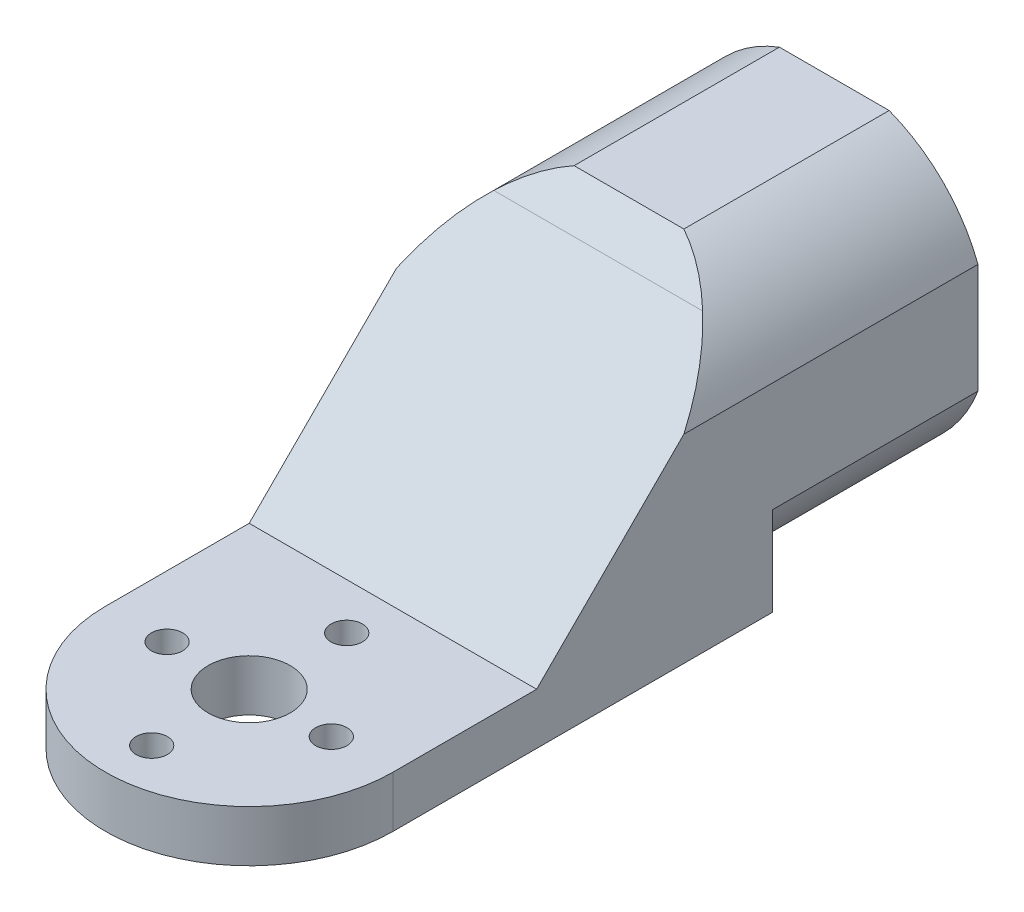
ISO-10303-21;
HEADER;
FILE_DESCRIPTION(('STEP AP214'),'2;1');
FILE_NAME('part.step','',(''),(''),'','','');
FILE_SCHEMA(('AUTOMOTIVE_DESIGN { 1 0 10303 214 1 1 1 1 }'));
ENDSEC;
DATA;
#1=APPLICATION_CONTEXT('core data for automotive mechanical design processes');
#2=APPLICATION_PROTOCOL_DEFINITION('international standard','automotive_design',2000,#1);
#3=PRODUCT_CONTEXT('',#1,'mechanical');
#4=PRODUCT('Part','Part','',(#3));
#5=PRODUCT_RELATED_PRODUCT_CATEGORY('part','',(#4));
#6=PRODUCT_DEFINITION_FORMATION('','',#4);
#7=PRODUCT_DEFINITION_CONTEXT('part definition',#1,'design');
#8=PRODUCT_DEFINITION('design','',#6,#7);
#9=PRODUCT_DEFINITION_SHAPE('','',#8);
#10=(LENGTH_UNIT() NAMED_UNIT(*) SI_UNIT(.MILLI.,.METRE.));
#11=(NAMED_UNIT(*) PLANE_ANGLE_UNIT() SI_UNIT($,.RADIAN.));
#12=(NAMED_UNIT(*) SI_UNIT($,.STERADIAN.) SOLID_ANGLE_UNIT());
#13=UNCERTAINTY_MEASURE_WITH_UNIT(LENGTH_MEASURE(1.E-05),#10,'distance_accuracy_value','');
#14=(GEOMETRIC_REPRESENTATION_CONTEXT(3) GLOBAL_UNCERTAINTY_ASSIGNED_CONTEXT((#13)) GLOBAL_UNIT_ASSIGNED_CONTEXT((#10,
#11,#12)) REPRESENTATION_CONTEXT('',''));
#15=CARTESIAN_POINT('',(0.,0.,0.));
#16=DIRECTION('',(0.,0.,1.));
#17=DIRECTION('',(1.,0.,0.));
#18=AXIS2_PLACEMENT_3D('',#15,#16,#17);
#19=CARTESIAN_POINT('',(0.,0.,-37.));
#20=DIRECTION('',(0.,0.,1.));
#21=DIRECTION('',(1.,0.,0.));
#22=AXIS2_PLACEMENT_3D('',#19,#20,#21);
#23=PLANE('',#22);
#24=CARTESIAN_POINT('',(0.,14.,-37.));
#25=DIRECTION('',(0.,0.,-1.));
#26=DIRECTION('',(-1.,0.,0.));
#27=AXIS2_PLACEMENT_3D('',#24,#25,#26);
#28=CIRCLE('',#27,14.986);
#29=CARTESIAN_POINT('',(-5.34604489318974,0.,-37.));
#30=VERTEX_POINT('',#29);
#31=CARTESIAN_POINT('',(-14.,8.65395510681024,-37.));
#32=VERTEX_POINT('',#31);
#33=EDGE_CURVE('E56',#30,#32,#28,.T.);
#34=ORIENTED_EDGE('',*,*,#33,.F.);
#35=DIRECTION('',(-1.,0.,0.));
#36=VECTOR('',#35,1.);
#37=CARTESIAN_POINT('',(14.,0.,-37.));
#38=LINE('',#37,#36);
#39=CARTESIAN_POINT('',(-14.,0.,-37.));
#40=VERTEX_POINT('',#39);
#41=EDGE_CURVE('E222',#30,#40,#38,.T.);
#42=ORIENTED_EDGE('',*,*,#41,.T.);
#43=DIRECTION('',(0.,1.,0.));
#44=VECTOR('',#43,1.);
#45=CARTESIAN_POINT('',(-14.,0.,-37.));
#46=LINE('',#45,#44);
#47=EDGE_CURVE('E53',#40,#32,#46,.T.);
#48=ORIENTED_EDGE('',*,*,#47,.T.);
#49=EDGE_LOOP('',(#34,#42,#48));
#50=FACE_BOUND('',#49,.T.);
#51=ADVANCED_FACE('F35',(#50),#23,.F.);
#52=CARTESIAN_POINT('',(14.,8.65395510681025,-37.));
#53=VERTEX_POINT('',#52);
#54=CARTESIAN_POINT('',(5.34604489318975,0.,-37.));
#55=VERTEX_POINT('',#54);
#56=EDGE_CURVE('E232',#53,#55,#28,.T.);
#57=ORIENTED_EDGE('',*,*,#56,.F.);
#58=DIRECTION('',(0.,-1.,0.));
#59=VECTOR('',#58,1.);
#60=CARTESIAN_POINT('',(14.,0.,-37.));
#61=LINE('',#60,#59);
#62=CARTESIAN_POINT('',(14.,0.,-37.));
#63=VERTEX_POINT('',#62);
#64=EDGE_CURVE('E140',#53,#63,#61,.T.);
#65=ORIENTED_EDGE('',*,*,#64,.T.);
#66=EDGE_CURVE('E221',#63,#55,#38,.T.);
#67=ORIENTED_EDGE('',*,*,#66,.T.);
#68=EDGE_LOOP('',(#57,#65,#67));
#69=FACE_BOUND('',#68,.T.);
#70=ADVANCED_FACE('F357',(#69),#23,.F.);
#71=CARTESIAN_POINT('',(-14.,5.,0.));
#72=DIRECTION('',(1.,0.,0.));
#73=DIRECTION('',(0.,0.,-1.));
#74=AXIS2_PLACEMENT_3D('',#71,#72,#73);
#75=PLANE('',#74);
#76=DIRECTION('',(0.,-0.707106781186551,0.707106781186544));
#77=VECTOR('',#76,1.);
#78=CARTESIAN_POINT('',(-14.,-2.00000000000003,-7.00000000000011));
#79=LINE('',#78,#77);
#80=CARTESIAN_POINT('',(-14.,5.,-14.0000000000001));
#81=VERTEX_POINT('',#80);
#82=CARTESIAN_POINT('',(-14.,19.3460448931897,-28.3460448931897));
#83=VERTEX_POINT('',#82);
#84=EDGE_CURVE('E11',#81,#83,#79,.F.);
#85=ORIENTED_EDGE('',*,*,#84,.T.);
#86=DIRECTION('',(0.,0.,1.));
#87=VECTOR('',#86,1.);
#88=CARTESIAN_POINT('',(-14.,19.3460448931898,-57.));
#89=LINE('',#88,#87);
#90=CARTESIAN_POINT('',(-14.,19.3460448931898,-57.));
#91=VERTEX_POINT('',#90);
#92=EDGE_CURVE('E130',#91,#83,#89,.T.);
#93=ORIENTED_EDGE('',*,*,#92,.F.);
#94=DIRECTION('',(0.,1.,0.));
#95=VECTOR('',#94,1.);
#96=CARTESIAN_POINT('',(-14.,0.,-57.));
#97=LINE('',#96,#95);
#98=CARTESIAN_POINT('',(-14.,8.65395510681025,-57.));
#99=VERTEX_POINT('',#98);
#100=EDGE_CURVE('E240',#99,#91,#97,.T.);
#101=ORIENTED_EDGE('',*,*,#100,.F.);
#102=DIRECTION('',(0.,0.,1.));
#103=VECTOR('',#102,1.);
#104=CARTESIAN_POINT('',(-14.,8.65395510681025,-57.));
#105=LINE('',#104,#103);
#106=EDGE_CURVE('E241',#99,#32,#105,.T.);
#107=ORIENTED_EDGE('',*,*,#106,.T.);
#108=ORIENTED_EDGE('',*,*,#47,.F.);
#109=DIRECTION('',(0.,0.,1.));
#110=VECTOR('',#109,1.);
#111=CARTESIAN_POINT('',(-14.,0.,0.));
#112=LINE('',#111,#110);
#113=CARTESIAN_POINT('',(-14.,0.,0.));
#114=VERTEX_POINT('',#113);
#115=EDGE_CURVE('E198',#40,#114,#112,.T.);
#116=ORIENTED_EDGE('',*,*,#115,.T.);
#117=DIRECTION('',(0.,-1.,0.));
#118=VECTOR('',#117,1.);
#119=CARTESIAN_POINT('',(-14.,5.,0.));
#120=LINE('',#119,#118);
#121=CARTESIAN_POINT('',(-14.,5.,0.));
#122=VERTEX_POINT('',#121);
#123=EDGE_CURVE('E157',#122,#114,#120,.T.);
#124=ORIENTED_EDGE('',*,*,#123,.F.);
#125=DIRECTION('',(0.,0.,1.));
#126=VECTOR('',#125,1.);
#127=CARTESIAN_POINT('',(-14.,5.,0.));
#128=LINE('',#127,#126);
#129=EDGE_CURVE('E155',#81,#122,#128,.T.);
#130=ORIENTED_EDGE('',*,*,#129,.F.);
#131=EDGE_LOOP('',(#85,#93,#101,#107,#108,#116,#124,#130));
#132=FACE_BOUND('',#131,.T.);
#133=ADVANCED_FACE('F153',(#132),#75,.F.);
#134=CARTESIAN_POINT('',(0.,5.,0.));
#135=DIRECTION('',(0.,-1.,0.));
#136=DIRECTION('',(0.,0.,-1.));
#137=AXIS2_PLACEMENT_3D('',#134,#135,#136);
#138=CYLINDRICAL_SURFACE('',#137,14.);
#139=CARTESIAN_POINT('',(0.,0.,0.));
#140=DIRECTION('',(0.,1.,0.));
#141=DIRECTION('',(0.,0.,1.));
#142=AXIS2_PLACEMENT_3D('',#139,#140,#141);
#143=CIRCLE('',#142,14.);
#144=CARTESIAN_POINT('',(14.,0.,0.));
#145=VERTEX_POINT('',#144);
#146=EDGE_CURVE('E195',#114,#145,#143,.T.);
#147=ORIENTED_EDGE('',*,*,#146,.T.);
#148=DIRECTION('',(0.,-1.,0.));
#149=VECTOR('',#148,1.);
#150=CARTESIAN_POINT('',(14.,5.,0.));
#151=LINE('',#150,#149);
#152=CARTESIAN_POINT('',(14.,5.,0.));
#153=VERTEX_POINT('',#152);
#154=EDGE_CURVE('E178',#153,#145,#151,.T.);
#155=ORIENTED_EDGE('',*,*,#154,.F.);
#156=CARTESIAN_POINT('',(0.,5.,0.));
#157=DIRECTION('',(0.,1.,0.));
#158=DIRECTION('',(0.,0.,1.));
#159=AXIS2_PLACEMENT_3D('',#156,#157,#158);
#160=CIRCLE('',#159,14.);
#161=EDGE_CURVE('E161',#122,#153,#160,.T.);
#162=ORIENTED_EDGE('',*,*,#161,.F.);
#163=ORIENTED_EDGE('',*,*,#123,.T.);
#164=EDGE_LOOP('',(#147,#155,#162,#163));
#165=FACE_BOUND('',#164,.T.);
#166=ADVANCED_FACE('F329',(#165),#138,.T.);
#167=CARTESIAN_POINT('',(8.,5.,0.));
#168=DIRECTION('',(0.,-1.,0.));
#169=DIRECTION('',(0.,0.,-1.));
#170=AXIS2_PLACEMENT_3D('',#167,#168,#169);
#171=CYLINDRICAL_SURFACE('',#170,1.525);
#172=CARTESIAN_POINT('',(8.,5.,0.));
#173=DIRECTION('',(0.,1.,0.));
#174=DIRECTION('',(0.,0.,1.));
#175=AXIS2_PLACEMENT_3D('',#172,#173,#174);
#176=CIRCLE('',#175,1.525);
#177=CARTESIAN_POINT('',(8.,5.,1.525));
#178=VERTEX_POINT('',#177);
#179=EDGE_CURVE('E202',#178,#178,#176,.T.);
#180=ORIENTED_EDGE('',*,*,#179,.T.);
#181=EDGE_LOOP('',(#180));
#182=FACE_BOUND('',#181,.T.);
#183=CARTESIAN_POINT('',(8.,0.,0.));
#184=DIRECTION('',(0.,1.,0.));
#185=DIRECTION('',(0.,0.,1.));
#186=AXIS2_PLACEMENT_3D('',#183,#184,#185);
#187=CIRCLE('',#186,1.525);
#188=CARTESIAN_POINT('',(8.,0.,1.525));
#189=VERTEX_POINT('',#188);
#190=EDGE_CURVE('E167',#189,#189,#187,.T.);
#191=ORIENTED_EDGE('',*,*,#190,.F.);
#192=EDGE_LOOP('',(#191));
#193=FACE_BOUND('',#192,.T.);
#194=ADVANCED_FACE('F434',(#182,#193),#171,.F.);
#195=CARTESIAN_POINT('',(-8.,5.,0.));
#196=DIRECTION('',(0.,-1.,0.));
#197=DIRECTION('',(0.,0.,-1.));
#198=AXIS2_PLACEMENT_3D('',#195,#196,#197);
#199=CYLINDRICAL_SURFACE('',#198,1.525);
#200=CARTESIAN_POINT('',(-8.,5.,0.));
#201=DIRECTION('',(0.,1.,0.));
#202=DIRECTION('',(0.,0.,1.));
#203=AXIS2_PLACEMENT_3D('',#200,#201,#202);
#204=CIRCLE('',#203,1.525);
#205=CARTESIAN_POINT('',(-8.,5.,1.525));
#206=VERTEX_POINT('',#205);
#207=EDGE_CURVE('E205',#206,#206,#204,.T.);
#208=ORIENTED_EDGE('',*,*,#207,.T.);
#209=EDGE_LOOP('',(#208));
#210=FACE_BOUND('',#209,.T.);
#211=CARTESIAN_POINT('',(-8.,0.,0.));
#212=DIRECTION('',(0.,1.,0.));
#213=DIRECTION('',(0.,0.,1.));
#214=AXIS2_PLACEMENT_3D('',#211,#212,#213);
#215=CIRCLE('',#214,1.525);
#216=CARTESIAN_POINT('',(-8.,0.,1.525));
#217=VERTEX_POINT('',#216);
#218=EDGE_CURVE('E183',#217,#217,#215,.T.);
#219=ORIENTED_EDGE('',*,*,#218,.F.);
#220=EDGE_LOOP('',(#219));
#221=FACE_BOUND('',#220,.T.);
#222=ADVANCED_FACE('F441',(#210,#221),#199,.F.);
#223=CARTESIAN_POINT('',(0.,5.,0.));
#224=DIRECTION('',(0.,-1.,0.));
#225=DIRECTION('',(0.,0.,-1.));
#226=AXIS2_PLACEMENT_3D('',#223,#224,#225);
#227=CYLINDRICAL_SURFACE('',#226,4.);
#228=CARTESIAN_POINT('',(0.,5.,0.));
#229=DIRECTION('',(0.,1.,0.));
#230=DIRECTION('',(0.,0.,1.));
#231=AXIS2_PLACEMENT_3D('',#228,#229,#230);
#232=CIRCLE('',#231,4.);
#233=CARTESIAN_POINT('',(0.,5.,4.));
#234=VERTEX_POINT('',#233);
#235=EDGE_CURVE('E208',#234,#234,#232,.T.);
#236=ORIENTED_EDGE('',*,*,#235,.T.);
#237=EDGE_LOOP('',(#236));
#238=FACE_BOUND('',#237,.T.);
#239=CARTESIAN_POINT('',(0.,0.,0.));
#240=DIRECTION('',(0.,1.,0.));
#241=DIRECTION('',(0.,0.,1.));
#242=AXIS2_PLACEMENT_3D('',#239,#240,#241);
#243=CIRCLE('',#242,4.);
#244=CARTESIAN_POINT('',(0.,0.,4.));
#245=VERTEX_POINT('',#244);
#246=EDGE_CURVE('E186',#245,#245,#243,.T.);
#247=ORIENTED_EDGE('',*,*,#246,.F.);
#248=EDGE_LOOP('',(#247));
#249=FACE_BOUND('',#248,.T.);
#250=ADVANCED_FACE('F449',(#238,#249),#227,.F.);
#251=CARTESIAN_POINT('',(0.,5.,9.5));
#252=DIRECTION('',(0.,-1.,0.));
#253=DIRECTION('',(0.,0.,-1.));
#254=AXIS2_PLACEMENT_3D('',#251,#252,#253);
#255=CYLINDRICAL_SURFACE('',#254,1.525);
#256=CARTESIAN_POINT('',(0.,5.,9.5));
#257=DIRECTION('',(0.,1.,0.));
#258=DIRECTION('',(0.,0.,1.));
#259=AXIS2_PLACEMENT_3D('',#256,#257,#258);
#260=CIRCLE('',#259,1.525);
#261=CARTESIAN_POINT('',(0.,5.,11.025));
#262=VERTEX_POINT('',#261);
#263=EDGE_CURVE('E211',#262,#262,#260,.T.);
#264=ORIENTED_EDGE('',*,*,#263,.T.);
#265=EDGE_LOOP('',(#264));
#266=FACE_BOUND('',#265,.T.);
#267=CARTESIAN_POINT('',(0.,0.,9.5));
#268=DIRECTION('',(0.,1.,0.));
#269=DIRECTION('',(0.,0.,1.));
#270=AXIS2_PLACEMENT_3D('',#267,#268,#269);
#271=CIRCLE('',#270,1.525);
#272=CARTESIAN_POINT('',(0.,0.,11.025));
#273=VERTEX_POINT('',#272);
#274=EDGE_CURVE('E189',#273,#273,#271,.T.);
#275=ORIENTED_EDGE('',*,*,#274,.F.);
#276=EDGE_LOOP('',(#275));
#277=FACE_BOUND('',#276,.T.);
#278=ADVANCED_FACE('F412',(#266,#277),#255,.F.);
#279=CARTESIAN_POINT('',(14.,5.,0.));
#280=DIRECTION('',(1.,0.,0.));
#281=DIRECTION('',(0.,0.,-1.));
#282=AXIS2_PLACEMENT_3D('',#279,#280,#281);
#283=PLANE('',#282);
#284=DIRECTION('',(0.,0.,1.));
#285=VECTOR('',#284,1.);
#286=CARTESIAN_POINT('',(14.,19.3460448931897,-57.));
#287=LINE('',#286,#285);
#288=CARTESIAN_POINT('',(14.,19.3460448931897,-57.));
#289=VERTEX_POINT('',#288);
#290=CARTESIAN_POINT('',(14.,19.3460448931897,-28.3460448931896));
#291=VERTEX_POINT('',#290);
#292=EDGE_CURVE('E264',#289,#291,#287,.T.);
#293=ORIENTED_EDGE('',*,*,#292,.T.);
#294=DIRECTION('',(0.,0.707106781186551,-0.707106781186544));
#295=VECTOR('',#294,1.);
#296=CARTESIAN_POINT('',(14.,25.0000000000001,-34.));
#297=LINE('',#296,#295);
#298=CARTESIAN_POINT('',(14.,5.,-14.0000000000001));
#299=VERTEX_POINT('',#298);
#300=EDGE_CURVE('E45',#291,#299,#297,.F.);
#301=ORIENTED_EDGE('',*,*,#300,.T.);
#302=DIRECTION('',(0.,0.,1.));
#303=VECTOR('',#302,1.);
#304=CARTESIAN_POINT('',(14.,5.,0.));
#305=LINE('',#304,#303);
#306=EDGE_CURVE('E164',#299,#153,#305,.T.);
#307=ORIENTED_EDGE('',*,*,#306,.T.);
#308=ORIENTED_EDGE('',*,*,#154,.T.);
#309=DIRECTION('',(0.,0.,1.));
#310=VECTOR('',#309,1.);
#311=CARTESIAN_POINT('',(14.,0.,0.));
#312=LINE('',#311,#310);
#313=EDGE_CURVE('E192',#63,#145,#312,.T.);
#314=ORIENTED_EDGE('',*,*,#313,.F.);
#315=ORIENTED_EDGE('',*,*,#64,.F.);
#316=DIRECTION('',(0.,0.,1.));
#317=VECTOR('',#316,1.);
#318=CARTESIAN_POINT('',(14.,8.65395510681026,-57.));
#319=LINE('',#318,#317);
#320=CARTESIAN_POINT('',(14.,8.65395510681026,-57.));
#321=VERTEX_POINT('',#320);
#322=EDGE_CURVE('E258',#321,#53,#319,.T.);
#323=ORIENTED_EDGE('',*,*,#322,.F.);
#324=DIRECTION('',(0.,-1.,0.));
#325=VECTOR('',#324,1.);
#326=CARTESIAN_POINT('',(14.,0.,-57.));
#327=LINE('',#326,#325);
#328=EDGE_CURVE('E283',#289,#321,#327,.T.);
#329=ORIENTED_EDGE('',*,*,#328,.F.);
#330=EDGE_LOOP('',(#293,#301,#307,#308,#314,#315,#323,#329));
#331=FACE_BOUND('',#330,.T.);
#332=ADVANCED_FACE('F298',(#331),#283,.T.);
#333=CARTESIAN_POINT('',(0.,5.,-9.5));
#334=DIRECTION('',(0.,-1.,0.));
#335=DIRECTION('',(0.,0.,-1.));
#336=AXIS2_PLACEMENT_3D('',#333,#334,#335);
#337=CYLINDRICAL_SURFACE('',#336,1.525);
#338=CARTESIAN_POINT('',(0.,5.,-9.5));
#339=DIRECTION('',(0.,1.,0.));
#340=DIRECTION('',(0.,0.,1.));
#341=AXIS2_PLACEMENT_3D('',#338,#339,#340);
#342=CIRCLE('',#341,1.525);
#343=CARTESIAN_POINT('',(0.,5.,-7.975));
#344=VERTEX_POINT('',#343);
#345=EDGE_CURVE('E179',#344,#344,#342,.T.);
#346=ORIENTED_EDGE('',*,*,#345,.T.);
#347=EDGE_LOOP('',(#346));
#348=FACE_BOUND('',#347,.T.);
#349=CARTESIAN_POINT('',(0.,0.,-9.5));
#350=DIRECTION('',(0.,1.,0.));
#351=DIRECTION('',(0.,0.,1.));
#352=AXIS2_PLACEMENT_3D('',#349,#350,#351);
#353=CIRCLE('',#352,1.525);
#354=CARTESIAN_POINT('',(0.,0.,-7.975));
#355=VERTEX_POINT('',#354);
#356=EDGE_CURVE('E162',#355,#355,#353,.T.);
#357=ORIENTED_EDGE('',*,*,#356,.F.);
#358=EDGE_LOOP('',(#357));
#359=FACE_BOUND('',#358,.T.);
#360=ADVANCED_FACE('F334',(#348,#359),#337,.F.);
#361=CARTESIAN_POINT('',(0.,5.,0.));
#362=DIRECTION('',(0.,1.,0.));
#363=DIRECTION('',(0.,0.,1.));
#364=AXIS2_PLACEMENT_3D('',#361,#362,#363);
#365=PLANE('',#364);
#366=ORIENTED_EDGE('',*,*,#306,.F.);
#367=DIRECTION('',(-1.,0.,0.));
#368=VECTOR('',#367,1.);
#369=CARTESIAN_POINT('',(-14.,5.,-14.0000000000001));
#370=LINE('',#369,#368);
#371=EDGE_CURVE('E321',#299,#81,#370,.T.);
#372=ORIENTED_EDGE('',*,*,#371,.T.);
#373=ORIENTED_EDGE('',*,*,#129,.T.);
#374=ORIENTED_EDGE('',*,*,#161,.T.);
#375=EDGE_LOOP('',(#366,#372,#373,#374));
#376=FACE_BOUND('',#375,.T.);
#377=ORIENTED_EDGE('',*,*,#263,.F.);
#378=EDGE_LOOP('',(#377));
#379=FACE_BOUND('',#378,.T.);
#380=ORIENTED_EDGE('',*,*,#235,.F.);
#381=EDGE_LOOP('',(#380));
#382=FACE_BOUND('',#381,.T.);
#383=ORIENTED_EDGE('',*,*,#207,.F.);
#384=EDGE_LOOP('',(#383));
#385=FACE_BOUND('',#384,.T.);
#386=ORIENTED_EDGE('',*,*,#179,.F.);
#387=EDGE_LOOP('',(#386));
#388=FACE_BOUND('',#387,.T.);
#389=ORIENTED_EDGE('',*,*,#345,.F.);
#390=EDGE_LOOP('',(#389));
#391=FACE_BOUND('',#390,.T.);
#392=ADVANCED_FACE('F331',(#376,#379,#382,#385,#388,#391),#365,.T.);
#393=CARTESIAN_POINT('',(0.,0.,0.));
#394=DIRECTION('',(0.,1.,0.));
#395=DIRECTION('',(0.,0.,1.));
#396=AXIS2_PLACEMENT_3D('',#393,#394,#395);
#397=PLANE('',#396);
#398=ORIENTED_EDGE('',*,*,#115,.F.);
#399=ORIENTED_EDGE('',*,*,#41,.F.);
#400=DIRECTION('',(0.,0.,1.));
#401=VECTOR('',#400,1.);
#402=CARTESIAN_POINT('',(-5.34604489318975,0.,-57.));
#403=LINE('',#402,#401);
#404=CARTESIAN_POINT('',(-5.34604489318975,0.,-57.));
#405=VERTEX_POINT('',#404);
#406=EDGE_CURVE('E259',#405,#30,#403,.T.);
#407=ORIENTED_EDGE('',*,*,#406,.F.);
#408=DIRECTION('',(-1.,0.,0.));
#409=VECTOR('',#408,1.);
#410=CARTESIAN_POINT('',(0.,0.,-57.));
#411=LINE('',#410,#409);
#412=CARTESIAN_POINT('',(5.34604489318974,0.,-57.));
#413=VERTEX_POINT('',#412);
#414=EDGE_CURVE('E245',#413,#405,#411,.T.);
#415=ORIENTED_EDGE('',*,*,#414,.F.);
#416=DIRECTION('',(0.,0.,1.));
#417=VECTOR('',#416,1.);
#418=CARTESIAN_POINT('',(5.34604489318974,0.,-57.));
#419=LINE('',#418,#417);
#420=EDGE_CURVE('E255',#413,#55,#419,.T.);
#421=ORIENTED_EDGE('',*,*,#420,.T.);
#422=ORIENTED_EDGE('',*,*,#66,.F.);
#423=ORIENTED_EDGE('',*,*,#313,.T.);
#424=ORIENTED_EDGE('',*,*,#146,.F.);
#425=EDGE_LOOP('',(#398,#399,#407,#415,#421,#422,#423,#424));
#426=FACE_BOUND('',#425,.T.);
#427=ORIENTED_EDGE('',*,*,#274,.T.);
#428=EDGE_LOOP('',(#427));
#429=FACE_BOUND('',#428,.T.);
#430=ORIENTED_EDGE('',*,*,#246,.T.);
#431=EDGE_LOOP('',(#430));
#432=FACE_BOUND('',#431,.T.);
#433=ORIENTED_EDGE('',*,*,#218,.T.);
#434=EDGE_LOOP('',(#433));
#435=FACE_BOUND('',#434,.T.);
#436=ORIENTED_EDGE('',*,*,#190,.T.);
#437=EDGE_LOOP('',(#436));
#438=FACE_BOUND('',#437,.T.);
#439=ORIENTED_EDGE('',*,*,#356,.T.);
#440=EDGE_LOOP('',(#439));
#441=FACE_BOUND('',#440,.T.);
#442=ADVANCED_FACE('F312',(#426,#429,#432,#435,#438,#441),#397,.F.);
#443=CARTESIAN_POINT('',(0.,25.0000000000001,-34.));
#444=DIRECTION('',(0.,0.707106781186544,0.707106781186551));
#445=DIRECTION('',(-1.,0.,0.));
#446=AXIS2_PLACEMENT_3D('',#443,#444,#445);
#447=PLANE('',#446);
#448=DIRECTION('',(1.,0.,0.));
#449=VECTOR('',#448,1.);
#450=CARTESIAN_POINT('',(14.,25.0000000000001,-34.));
#451=LINE('',#450,#449);
#452=CARTESIAN_POINT('',(-10.1774356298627,25.0000000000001,-34.));
#453=VERTEX_POINT('',#452);
#454=CARTESIAN_POINT('',(10.1774356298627,25.0000000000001,-34.));
#455=VERTEX_POINT('',#454);
#456=EDGE_CURVE('E149',#453,#455,#451,.T.);
#457=ORIENTED_EDGE('',*,*,#456,.F.);
#458=CARTESIAN_POINT('',(0.,14.,-23.));
#459=DIRECTION('',(0.,0.707106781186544,0.707106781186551));
#460=DIRECTION('',(0.,0.707106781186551,-0.707106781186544));
#461=AXIS2_PLACEMENT_3D('',#458,#459,#460);
#462=ELLIPSE('',#461,21.1934044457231,14.986);
#463=EDGE_CURVE('E133',#453,#83,#462,.T.);
#464=ORIENTED_EDGE('',*,*,#463,.T.);
#465=ORIENTED_EDGE('',*,*,#84,.F.);
#466=ORIENTED_EDGE('',*,*,#371,.F.);
#467=ORIENTED_EDGE('',*,*,#300,.F.);
#468=CARTESIAN_POINT('',(0.,14.,-23.));
#469=DIRECTION('',(0.,0.707106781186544,0.707106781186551));
#470=DIRECTION('',(0.,0.707106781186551,-0.707106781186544));
#471=AXIS2_PLACEMENT_3D('',#468,#469,#470);
#472=ELLIPSE('',#471,21.1934044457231,14.986);
#473=EDGE_CURVE('E233',#291,#455,#472,.T.);
#474=ORIENTED_EDGE('',*,*,#473,.T.);
#475=EDGE_LOOP('',(#457,#464,#465,#466,#467,#474));
#476=FACE_BOUND('',#475,.T.);
#477=ADVANCED_FACE('F146',(#476),#447,.T.);
#478=CARTESIAN_POINT('',(14.,28.,-37.));
#479=DIRECTION('',(0.,0.707106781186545,0.70710678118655));
#480=DIRECTION('',(-1.,0.,0.));
#481=AXIS2_PLACEMENT_3D('',#478,#479,#480);
#482=PLANE('',#481);
#483=CARTESIAN_POINT('',(0.,14.,-23.0000000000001));
#484=DIRECTION('',(0.,0.707106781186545,0.70710678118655));
#485=DIRECTION('',(0.,0.70710678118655,-0.707106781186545));
#486=AXIS2_PLACEMENT_3D('',#483,#484,#485);
#487=ELLIPSE('',#486,21.1934044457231,14.986);
#488=CARTESIAN_POINT('',(-5.34604489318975,28.,-37.));
#489=VERTEX_POINT('',#488);
#490=EDGE_CURVE('E39',#453,#489,#487,.F.);
#491=ORIENTED_EDGE('',*,*,#490,.F.);
#492=ORIENTED_EDGE('',*,*,#456,.T.);
#493=CARTESIAN_POINT('',(0.,14.,-23.0000000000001));
#494=DIRECTION('',(0.,0.707106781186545,0.70710678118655));
#495=DIRECTION('',(0.,0.70710678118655,-0.707106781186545));
#496=AXIS2_PLACEMENT_3D('',#493,#494,#495);
#497=ELLIPSE('',#496,21.1934044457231,14.986);
#498=CARTESIAN_POINT('',(5.34604489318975,28.,-37.));
#499=VERTEX_POINT('',#498);
#500=EDGE_CURVE('E150',#499,#455,#497,.F.);
#501=ORIENTED_EDGE('',*,*,#500,.F.);
#502=DIRECTION('',(1.,0.,0.));
#503=VECTOR('',#502,1.);
#504=CARTESIAN_POINT('',(0.,28.,-37.));
#505=LINE('',#504,#503);
#506=EDGE_CURVE('E229',#489,#499,#505,.T.);
#507=ORIENTED_EDGE('',*,*,#506,.F.);
#508=EDGE_LOOP('',(#491,#492,#501,#507));
#509=FACE_BOUND('',#508,.T.);
#510=ADVANCED_FACE('F37',(#509),#482,.T.);
#511=CARTESIAN_POINT('',(0.,14.,-57.));
#512=DIRECTION('',(0.,0.,1.));
#513=DIRECTION('',(1.,0.,0.));
#514=AXIS2_PLACEMENT_3D('',#511,#512,#513);
#515=CYLINDRICAL_SURFACE('',#514,14.986);
#516=ORIENTED_EDGE('',*,*,#92,.T.);
#517=ORIENTED_EDGE('',*,*,#463,.F.);
#518=ORIENTED_EDGE('',*,*,#490,.T.);
#519=DIRECTION('',(0.,0.,1.));
#520=VECTOR('',#519,1.);
#521=CARTESIAN_POINT('',(-5.34604489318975,28.,-57.));
#522=LINE('',#521,#520);
#523=CARTESIAN_POINT('',(-5.34604489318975,28.,-57.));
#524=VERTEX_POINT('',#523);
#525=EDGE_CURVE('E141',#524,#489,#522,.T.);
#526=ORIENTED_EDGE('',*,*,#525,.F.);
#527=CARTESIAN_POINT('',(0.,14.,-57.));
#528=DIRECTION('',(0.,0.,-1.));
#529=DIRECTION('',(-1.,0.,0.));
#530=AXIS2_PLACEMENT_3D('',#527,#528,#529);
#531=CIRCLE('',#530,14.986);
#532=EDGE_CURVE('E136',#91,#524,#531,.T.);
#533=ORIENTED_EDGE('',*,*,#532,.F.);
#534=EDGE_LOOP('',(#516,#517,#518,#526,#533));
#535=FACE_BOUND('',#534,.T.);
#536=ADVANCED_FACE('F132',(#535),#515,.T.);
#537=CARTESIAN_POINT('',(0.,28.,-57.));
#538=DIRECTION('',(0.,-1.,0.));
#539=DIRECTION('',(0.,0.,-1.));
#540=AXIS2_PLACEMENT_3D('',#537,#538,#539);
#541=PLANE('',#540);
#542=ORIENTED_EDGE('',*,*,#506,.T.);
#543=DIRECTION('',(0.,0.,1.));
#544=VECTOR('',#543,1.);
#545=CARTESIAN_POINT('',(5.34604489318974,28.,-57.));
#546=LINE('',#545,#544);
#547=CARTESIAN_POINT('',(5.34604489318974,28.,-57.));
#548=VERTEX_POINT('',#547);
#549=EDGE_CURVE('E226',#548,#499,#546,.T.);
#550=ORIENTED_EDGE('',*,*,#549,.F.);
#551=DIRECTION('',(1.,0.,0.));
#552=VECTOR('',#551,1.);
#553=CARTESIAN_POINT('',(0.,28.,-57.));
#554=LINE('',#553,#552);
#555=EDGE_CURVE('E280',#524,#548,#554,.T.);
#556=ORIENTED_EDGE('',*,*,#555,.F.);
#557=ORIENTED_EDGE('',*,*,#525,.T.);
#558=EDGE_LOOP('',(#542,#550,#556,#557));
#559=FACE_BOUND('',#558,.T.);
#560=ADVANCED_FACE('F319',(#559),#541,.F.);
#561=ORIENTED_EDGE('',*,*,#549,.T.);
#562=ORIENTED_EDGE('',*,*,#500,.T.);
#563=ORIENTED_EDGE('',*,*,#473,.F.);
#564=ORIENTED_EDGE('',*,*,#292,.F.);
#565=EDGE_CURVE('E282',#548,#289,#531,.T.);
#566=ORIENTED_EDGE('',*,*,#565,.F.);
#567=EDGE_LOOP('',(#561,#562,#563,#564,#566));
#568=FACE_BOUND('',#567,.T.);
#569=ADVANCED_FACE('F295',(#568),#515,.T.);
#570=ORIENTED_EDGE('',*,*,#56,.T.);
#571=ORIENTED_EDGE('',*,*,#420,.F.);
#572=EDGE_CURVE('E284',#321,#413,#531,.T.);
#573=ORIENTED_EDGE('',*,*,#572,.F.);
#574=ORIENTED_EDGE('',*,*,#322,.T.);
#575=EDGE_LOOP('',(#570,#571,#573,#574));
#576=FACE_BOUND('',#575,.T.);
#577=ADVANCED_FACE('F304',(#576),#515,.T.);
#578=ORIENTED_EDGE('',*,*,#33,.T.);
#579=ORIENTED_EDGE('',*,*,#106,.F.);
#580=EDGE_CURVE('E281',#405,#99,#531,.T.);
#581=ORIENTED_EDGE('',*,*,#580,.F.);
#582=ORIENTED_EDGE('',*,*,#406,.T.);
#583=EDGE_LOOP('',(#578,#579,#581,#582));
#584=FACE_BOUND('',#583,.T.);
#585=ADVANCED_FACE('F315',(#584),#515,.T.);
#586=CARTESIAN_POINT('',(0.,0.,-57.));
#587=DIRECTION('',(0.,0.,-1.));
#588=DIRECTION('',(-1.,0.,0.));
#589=AXIS2_PLACEMENT_3D('',#586,#587,#588);
#590=PLANE('',#589);
#591=ORIENTED_EDGE('',*,*,#100,.T.);
#592=ORIENTED_EDGE('',*,*,#532,.T.);
#593=ORIENTED_EDGE('',*,*,#555,.T.);
#594=ORIENTED_EDGE('',*,*,#565,.T.);
#595=ORIENTED_EDGE('',*,*,#328,.T.);
#596=ORIENTED_EDGE('',*,*,#572,.T.);
#597=ORIENTED_EDGE('',*,*,#414,.T.);
#598=ORIENTED_EDGE('',*,*,#580,.T.);
#599=EDGE_LOOP('',(#591,#592,#593,#594,#595,#596,#597,#598));
#600=FACE_BOUND('',#599,.T.);
#601=ADVANCED_FACE('F290',(#600),#590,.T.);
#602=CLOSED_SHELL('',(#51,#70,#133,#166,#194,#222,#250,#278,#332,#360,#392,#442,#477,#510,#536,
#560,#569,#577,#585,#601));
#603=MANIFOLD_SOLID_BREP('B2',#602);
#604=ADVANCED_BREP_SHAPE_REPRESENTATION('',(#18,#603),#14);
#605=SHAPE_DEFINITION_REPRESENTATION(#9,#604);
ENDSEC;
END-ISO-10303-21;
